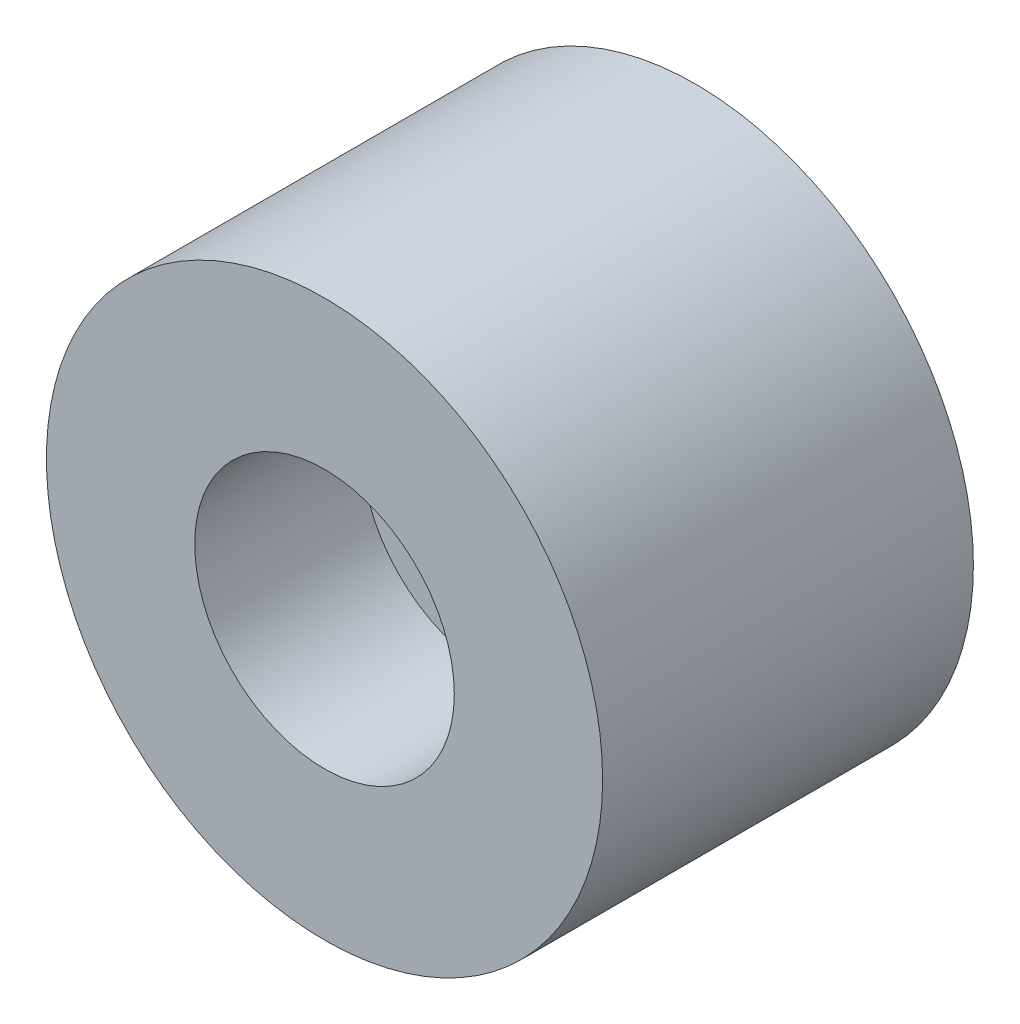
ISO-10303-21;
HEADER;
FILE_DESCRIPTION(('STEP AP214'),'2;1');
FILE_NAME('part.step','',(''),(''),'','','');
FILE_SCHEMA(('AUTOMOTIVE_DESIGN { 1 0 10303 214 1 1 1 1 }'));
ENDSEC;
DATA;
#1=APPLICATION_CONTEXT('core data for automotive mechanical design processes');
#2=APPLICATION_PROTOCOL_DEFINITION('international standard','automotive_design',2000,#1);
#3=PRODUCT_CONTEXT('',#1,'mechanical');
#4=PRODUCT('Part','Part','',(#3));
#5=PRODUCT_RELATED_PRODUCT_CATEGORY('part','',(#4));
#6=PRODUCT_DEFINITION_FORMATION('','',#4);
#7=PRODUCT_DEFINITION_CONTEXT('part definition',#1,'design');
#8=PRODUCT_DEFINITION('design','',#6,#7);
#9=PRODUCT_DEFINITION_SHAPE('','',#8);
#10=(LENGTH_UNIT() NAMED_UNIT(*) SI_UNIT(.MILLI.,.METRE.));
#11=(NAMED_UNIT(*) PLANE_ANGLE_UNIT() SI_UNIT($,.RADIAN.));
#12=(NAMED_UNIT(*) SI_UNIT($,.STERADIAN.) SOLID_ANGLE_UNIT());
#13=UNCERTAINTY_MEASURE_WITH_UNIT(LENGTH_MEASURE(1.E-05),#10,'distance_accuracy_value','');
#14=(GEOMETRIC_REPRESENTATION_CONTEXT(3) GLOBAL_UNCERTAINTY_ASSIGNED_CONTEXT((#13)) GLOBAL_UNIT_ASSIGNED_CONTEXT((#10,
#11,#12)) REPRESENTATION_CONTEXT('',''));
#15=CARTESIAN_POINT('',(0.,0.,0.));
#16=DIRECTION('',(0.,0.,1.));
#17=DIRECTION('',(1.,0.,0.));
#18=AXIS2_PLACEMENT_3D('',#15,#16,#17);
#19=CARTESIAN_POINT('',(0.,0.,20.));
#20=DIRECTION('',(0.,0.,1.));
#21=DIRECTION('',(1.,0.,0.));
#22=AXIS2_PLACEMENT_3D('',#19,#20,#21);
#23=PLANE('',#22);
#24=CARTESIAN_POINT('',(0.,0.,20.));
#25=DIRECTION('',(0.,0.,1.));
#26=DIRECTION('',(1.,0.,0.));
#27=AXIS2_PLACEMENT_3D('',#24,#25,#26);
#28=CIRCLE('',#27,15.);
#29=CARTESIAN_POINT('',(15.,0.,20.));
#30=VERTEX_POINT('',#29);
#31=EDGE_CURVE('E8',#30,#30,#28,.T.);
#32=ORIENTED_EDGE('',*,*,#31,.T.);
#33=EDGE_LOOP('',(#32));
#34=FACE_BOUND('',#33,.T.);
#35=CARTESIAN_POINT('',(0.,0.,20.));
#36=DIRECTION('',(0.,0.,1.));
#37=DIRECTION('',(1.,0.,0.));
#38=AXIS2_PLACEMENT_3D('',#35,#36,#37);
#39=CIRCLE('',#38,7.);
#40=CARTESIAN_POINT('',(7.,0.,20.));
#41=VERTEX_POINT('',#40);
#42=EDGE_CURVE('E32',#41,#41,#39,.T.);
#43=ORIENTED_EDGE('',*,*,#42,.F.);
#44=EDGE_LOOP('',(#43));
#45=FACE_BOUND('',#44,.T.);
#46=ADVANCED_FACE('F12',(#34,#45),#23,.T.);
#47=CARTESIAN_POINT('',(0.,0.,0.));
#48=DIRECTION('',(0.,0.,1.));
#49=DIRECTION('',(1.,0.,0.));
#50=AXIS2_PLACEMENT_3D('',#47,#48,#49);
#51=PLANE('',#50);
#52=CARTESIAN_POINT('',(0.,0.,0.));
#53=DIRECTION('',(0.,0.,1.));
#54=DIRECTION('',(1.,0.,0.));
#55=AXIS2_PLACEMENT_3D('',#52,#53,#54);
#56=CIRCLE('',#55,15.);
#57=CARTESIAN_POINT('',(15.,0.,0.));
#58=VERTEX_POINT('',#57);
#59=EDGE_CURVE('E20',#58,#58,#56,.T.);
#60=ORIENTED_EDGE('',*,*,#59,.F.);
#61=EDGE_LOOP('',(#60));
#62=FACE_BOUND('',#61,.T.);
#63=CARTESIAN_POINT('',(0.,0.,0.));
#64=DIRECTION('',(0.,0.,1.));
#65=DIRECTION('',(1.,0.,0.));
#66=AXIS2_PLACEMENT_3D('',#63,#64,#65);
#67=CIRCLE('',#66,3.5);
#68=CARTESIAN_POINT('',(3.5,0.,0.));
#69=VERTEX_POINT('',#68);
#70=EDGE_CURVE('E16',#69,#69,#67,.F.);
#71=ORIENTED_EDGE('',*,*,#70,.F.);
#72=EDGE_LOOP('',(#71));
#73=FACE_BOUND('',#72,.T.);
#74=ADVANCED_FACE('F40',(#62,#73),#51,.F.);
#75=CARTESIAN_POINT('',(0.,0.,20.));
#76=DIRECTION('',(0.,0.,-1.));
#77=DIRECTION('',(-1.,0.,0.));
#78=AXIS2_PLACEMENT_3D('',#75,#76,#77);
#79=CYLINDRICAL_SURFACE('',#78,15.);
#80=ORIENTED_EDGE('',*,*,#31,.F.);
#81=EDGE_LOOP('',(#80));
#82=FACE_BOUND('',#81,.T.);
#83=ORIENTED_EDGE('',*,*,#59,.T.);
#84=EDGE_LOOP('',(#83));
#85=FACE_BOUND('',#84,.T.);
#86=ADVANCED_FACE('F14',(#82,#85),#79,.T.);
#87=CARTESIAN_POINT('',(0.,0.,20.));
#88=DIRECTION('',(0.,0.,1.));
#89=DIRECTION('',(1.,0.,0.));
#90=AXIS2_PLACEMENT_3D('',#87,#88,#89);
#91=CYLINDRICAL_SURFACE('',#90,3.5);
#92=CARTESIAN_POINT('',(0.,0.,11.));
#93=DIRECTION('',(0.,0.,1.));
#94=DIRECTION('',(1.,0.,0.));
#95=AXIS2_PLACEMENT_3D('',#92,#93,#94);
#96=CIRCLE('',#95,3.5);
#97=CARTESIAN_POINT('',(3.5,0.,11.));
#98=VERTEX_POINT('',#97);
#99=EDGE_CURVE('E26',#98,#98,#96,.T.);
#100=ORIENTED_EDGE('',*,*,#99,.T.);
#101=EDGE_LOOP('',(#100));
#102=FACE_BOUND('',#101,.T.);
#103=ORIENTED_EDGE('',*,*,#70,.T.);
#104=EDGE_LOOP('',(#103));
#105=FACE_BOUND('',#104,.T.);
#106=ADVANCED_FACE('F49',(#102,#105),#91,.F.);
#107=CARTESIAN_POINT('',(3.5,0.,11.));
#108=DIRECTION('',(0.,0.,1.));
#109=DIRECTION('',(1.,0.,0.));
#110=AXIS2_PLACEMENT_3D('',#107,#108,#109);
#111=PLANE('',#110);
#112=CARTESIAN_POINT('',(0.,0.,11.));
#113=DIRECTION('',(0.,0.,1.));
#114=DIRECTION('',(1.,0.,0.));
#115=AXIS2_PLACEMENT_3D('',#112,#113,#114);
#116=CIRCLE('',#115,7.);
#117=CARTESIAN_POINT('',(7.,0.,11.));
#118=VERTEX_POINT('',#117);
#119=EDGE_CURVE('E29',#118,#118,#116,.T.);
#120=ORIENTED_EDGE('',*,*,#119,.T.);
#121=EDGE_LOOP('',(#120));
#122=FACE_BOUND('',#121,.T.);
#123=ORIENTED_EDGE('',*,*,#99,.F.);
#124=EDGE_LOOP('',(#123));
#125=FACE_BOUND('',#124,.T.);
#126=ADVANCED_FACE('F52',(#122,#125),#111,.T.);
#127=CARTESIAN_POINT('',(0.,0.,20.));
#128=DIRECTION('',(0.,0.,1.));
#129=DIRECTION('',(1.,0.,0.));
#130=AXIS2_PLACEMENT_3D('',#127,#128,#129);
#131=CYLINDRICAL_SURFACE('',#130,7.);
#132=ORIENTED_EDGE('',*,*,#42,.T.);
#133=EDGE_LOOP('',(#132));
#134=FACE_BOUND('',#133,.T.);
#135=ORIENTED_EDGE('',*,*,#119,.F.);
#136=EDGE_LOOP('',(#135));
#137=FACE_BOUND('',#136,.T.);
#138=ADVANCED_FACE('F36',(#134,#137),#131,.F.);
#139=CLOSED_SHELL('',(#46,#74,#86,#106,#126,#138));
#140=MANIFOLD_SOLID_BREP('B1',#139);
#141=ADVANCED_BREP_SHAPE_REPRESENTATION('',(#18,#140),#14);
#142=SHAPE_DEFINITION_REPRESENTATION(#9,#141);
ENDSEC;
END-ISO-10303-21;
